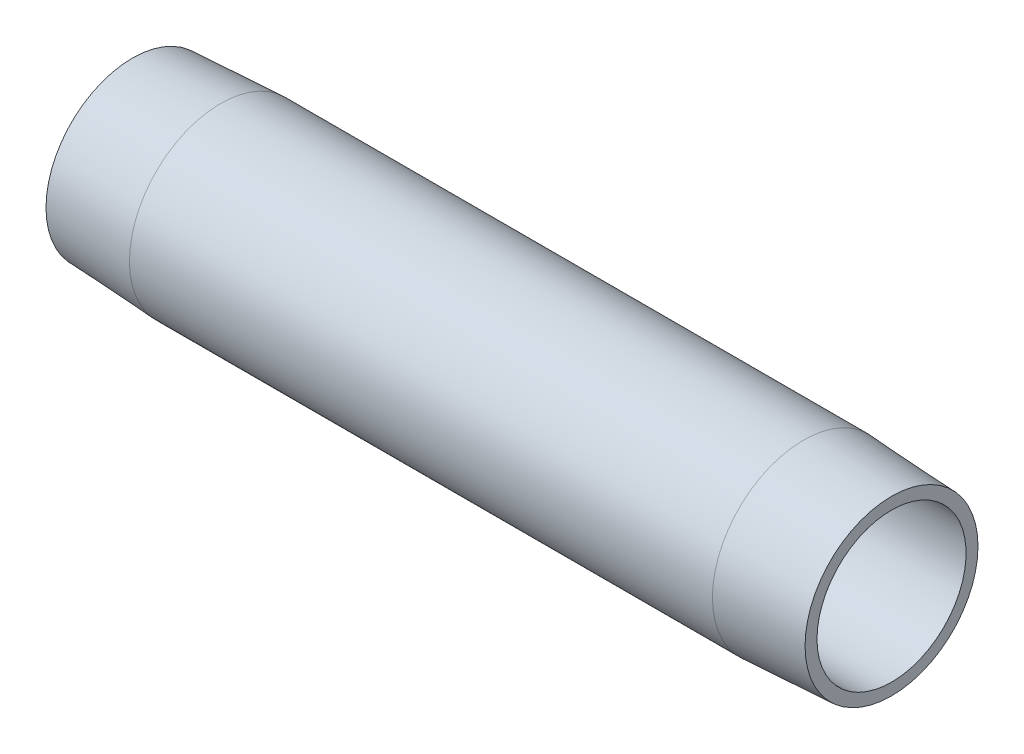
ISO-10303-21;
HEADER;
FILE_DESCRIPTION(('STEP AP214'),'2;1');
FILE_NAME('part.step','',(''),(''),'','','');
FILE_SCHEMA(('AUTOMOTIVE_DESIGN { 1 0 10303 214 1 1 1 1 }'));
ENDSEC;
DATA;
#1=APPLICATION_CONTEXT('core data for automotive mechanical design processes');
#2=APPLICATION_PROTOCOL_DEFINITION('international standard','automotive_design',2000,#1);
#3=PRODUCT_CONTEXT('',#1,'mechanical');
#4=PRODUCT('Part','Part','',(#3));
#5=PRODUCT_RELATED_PRODUCT_CATEGORY('part','',(#4));
#6=PRODUCT_DEFINITION_FORMATION('','',#4);
#7=PRODUCT_DEFINITION_CONTEXT('part definition',#1,'design');
#8=PRODUCT_DEFINITION('design','',#6,#7);
#9=PRODUCT_DEFINITION_SHAPE('','',#8);
#10=(LENGTH_UNIT() NAMED_UNIT(*) SI_UNIT(.MILLI.,.METRE.));
#11=(NAMED_UNIT(*) PLANE_ANGLE_UNIT() SI_UNIT($,.RADIAN.));
#12=(NAMED_UNIT(*) SI_UNIT($,.STERADIAN.) SOLID_ANGLE_UNIT());
#13=UNCERTAINTY_MEASURE_WITH_UNIT(LENGTH_MEASURE(1.E-05),#10,'distance_accuracy_value','');
#14=(GEOMETRIC_REPRESENTATION_CONTEXT(3) GLOBAL_UNCERTAINTY_ASSIGNED_CONTEXT((#13)) GLOBAL_UNIT_ASSIGNED_CONTEXT((#10,
#11,#12)) REPRESENTATION_CONTEXT('',''));
#15=CARTESIAN_POINT('',(0.,0.,0.));
#16=DIRECTION('',(0.,0.,1.));
#17=DIRECTION('',(1.,0.,0.));
#18=AXIS2_PLACEMENT_3D('',#15,#16,#17);
#19=CARTESIAN_POINT('',(88.9,8.73125,0.));
#20=DIRECTION('',(-1.,0.,0.));
#21=DIRECTION('',(0.,0.,1.));
#22=AXIS2_PLACEMENT_3D('',#19,#20,#21);
#23=PLANE('',#22);
#24=CARTESIAN_POINT('',(88.9,0.,0.));
#25=DIRECTION('',(-1.,0.,0.));
#26=DIRECTION('',(0.,0.,1.));
#27=AXIS2_PLACEMENT_3D('',#24,#25,#26);
#28=CIRCLE('',#27,10.1275500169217);
#29=CARTESIAN_POINT('',(88.9,0.,10.1275500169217));
#30=VERTEX_POINT('',#29);
#31=EDGE_CURVE('E10',#30,#30,#28,.T.);
#32=ORIENTED_EDGE('',*,*,#31,.F.);
#33=EDGE_LOOP('',(#32));
#34=FACE_BOUND('',#33,.T.);
#35=CARTESIAN_POINT('',(88.9,0.,0.));
#36=DIRECTION('',(-1.,0.,0.));
#37=DIRECTION('',(0.,0.,1.));
#38=AXIS2_PLACEMENT_3D('',#35,#36,#37);
#39=CIRCLE('',#38,8.73125);
#40=CARTESIAN_POINT('',(88.9,0.,8.73125));
#41=VERTEX_POINT('',#40);
#42=EDGE_CURVE('E52',#41,#41,#39,.T.);
#43=ORIENTED_EDGE('',*,*,#42,.T.);
#44=EDGE_LOOP('',(#43));
#45=FACE_BOUND('',#44,.T.);
#46=ADVANCED_FACE('F30',(#34,#45),#23,.F.);
#47=CARTESIAN_POINT('',(88.9,0.,0.));
#48=DIRECTION('',(-1.,0.,0.));
#49=DIRECTION('',(0.,0.,1.));
#50=AXIS2_PLACEMENT_3D('',#47,#48,#49);
#51=CONICAL_SURFACE('',#50,10.1275500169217,0.052359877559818);
#52=CARTESIAN_POINT('',(78.5876,0.,0.));
#53=DIRECTION('',(-1.,0.,0.));
#54=DIRECTION('',(0.,0.,1.));
#55=AXIS2_PLACEMENT_3D('',#52,#53,#54);
#56=CIRCLE('',#55,10.668);
#57=CARTESIAN_POINT('',(78.5876,0.,10.668));
#58=VERTEX_POINT('',#57);
#59=EDGE_CURVE('E36',#58,#58,#56,.T.);
#60=ORIENTED_EDGE('',*,*,#59,.F.);
#61=EDGE_LOOP('',(#60));
#62=FACE_BOUND('',#61,.T.);
#63=ORIENTED_EDGE('',*,*,#31,.T.);
#64=EDGE_LOOP('',(#63));
#65=FACE_BOUND('',#64,.T.);
#66=ADVANCED_FACE('F77',(#62,#65),#51,.T.);
#67=CARTESIAN_POINT('',(0.,0.,0.));
#68=DIRECTION('',(-1.,0.,0.));
#69=DIRECTION('',(0.,0.,1.));
#70=AXIS2_PLACEMENT_3D('',#67,#68,#69);
#71=CYLINDRICAL_SURFACE('',#70,10.668);
#72=CARTESIAN_POINT('',(10.3124,0.,0.));
#73=DIRECTION('',(-1.,0.,0.));
#74=DIRECTION('',(0.,0.,1.));
#75=AXIS2_PLACEMENT_3D('',#72,#73,#74);
#76=CIRCLE('',#75,10.668);
#77=CARTESIAN_POINT('',(10.3124,0.,10.668));
#78=VERTEX_POINT('',#77);
#79=EDGE_CURVE('E40',#78,#78,#76,.T.);
#80=ORIENTED_EDGE('',*,*,#79,.F.);
#81=EDGE_LOOP('',(#80));
#82=FACE_BOUND('',#81,.T.);
#83=ORIENTED_EDGE('',*,*,#59,.T.);
#84=EDGE_LOOP('',(#83));
#85=FACE_BOUND('',#84,.T.);
#86=ADVANCED_FACE('F72',(#82,#85),#71,.T.);
#87=CARTESIAN_POINT('',(10.3124,0.,0.));
#88=DIRECTION('',(1.,0.,0.));
#89=DIRECTION('',(0.,0.,-1.));
#90=AXIS2_PLACEMENT_3D('',#87,#88,#89);
#91=CONICAL_SURFACE('',#90,10.668,0.0523598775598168);
#92=CARTESIAN_POINT('',(0.,0.,0.));
#93=DIRECTION('',(-1.,0.,0.));
#94=DIRECTION('',(0.,0.,1.));
#95=AXIS2_PLACEMENT_3D('',#92,#93,#94);
#96=CIRCLE('',#95,10.1275500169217);
#97=CARTESIAN_POINT('',(0.,0.,10.1275500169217));
#98=VERTEX_POINT('',#97);
#99=EDGE_CURVE('E44',#98,#98,#96,.T.);
#100=ORIENTED_EDGE('',*,*,#99,.F.);
#101=EDGE_LOOP('',(#100));
#102=FACE_BOUND('',#101,.T.);
#103=ORIENTED_EDGE('',*,*,#79,.T.);
#104=EDGE_LOOP('',(#103));
#105=FACE_BOUND('',#104,.T.);
#106=ADVANCED_FACE('F66',(#102,#105),#91,.T.);
#107=CARTESIAN_POINT('',(0.,10.1275500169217,0.));
#108=DIRECTION('',(1.,0.,0.));
#109=DIRECTION('',(0.,0.,-1.));
#110=AXIS2_PLACEMENT_3D('',#107,#108,#109);
#111=PLANE('',#110);
#112=CARTESIAN_POINT('',(0.,0.,0.));
#113=DIRECTION('',(-1.,0.,0.));
#114=DIRECTION('',(0.,0.,1.));
#115=AXIS2_PLACEMENT_3D('',#112,#113,#114);
#116=CIRCLE('',#115,8.73125);
#117=CARTESIAN_POINT('',(0.,0.,8.73125));
#118=VERTEX_POINT('',#117);
#119=EDGE_CURVE('E49',#118,#118,#116,.T.);
#120=ORIENTED_EDGE('',*,*,#119,.F.);
#121=EDGE_LOOP('',(#120));
#122=FACE_BOUND('',#121,.T.);
#123=ORIENTED_EDGE('',*,*,#99,.T.);
#124=EDGE_LOOP('',(#123));
#125=FACE_BOUND('',#124,.T.);
#126=ADVANCED_FACE('F60',(#122,#125),#111,.F.);
#127=CARTESIAN_POINT('',(0.,0.,0.));
#128=DIRECTION('',(-1.,0.,0.));
#129=DIRECTION('',(0.,0.,1.));
#130=AXIS2_PLACEMENT_3D('',#127,#128,#129);
#131=CYLINDRICAL_SURFACE('',#130,8.73125);
#132=ORIENTED_EDGE('',*,*,#42,.F.);
#133=EDGE_LOOP('',(#132));
#134=FACE_BOUND('',#133,.T.);
#135=ORIENTED_EDGE('',*,*,#119,.T.);
#136=EDGE_LOOP('',(#135));
#137=FACE_BOUND('',#136,.T.);
#138=ADVANCED_FACE('F57',(#134,#137),#131,.F.);
#139=CLOSED_SHELL('',(#46,#66,#86,#106,#126,#138));
#140=MANIFOLD_SOLID_BREP('B2',#139);
#141=ADVANCED_BREP_SHAPE_REPRESENTATION('',(#18,#140),#14);
#142=SHAPE_DEFINITION_REPRESENTATION(#9,#141);
ENDSEC;
END-ISO-10303-21;
